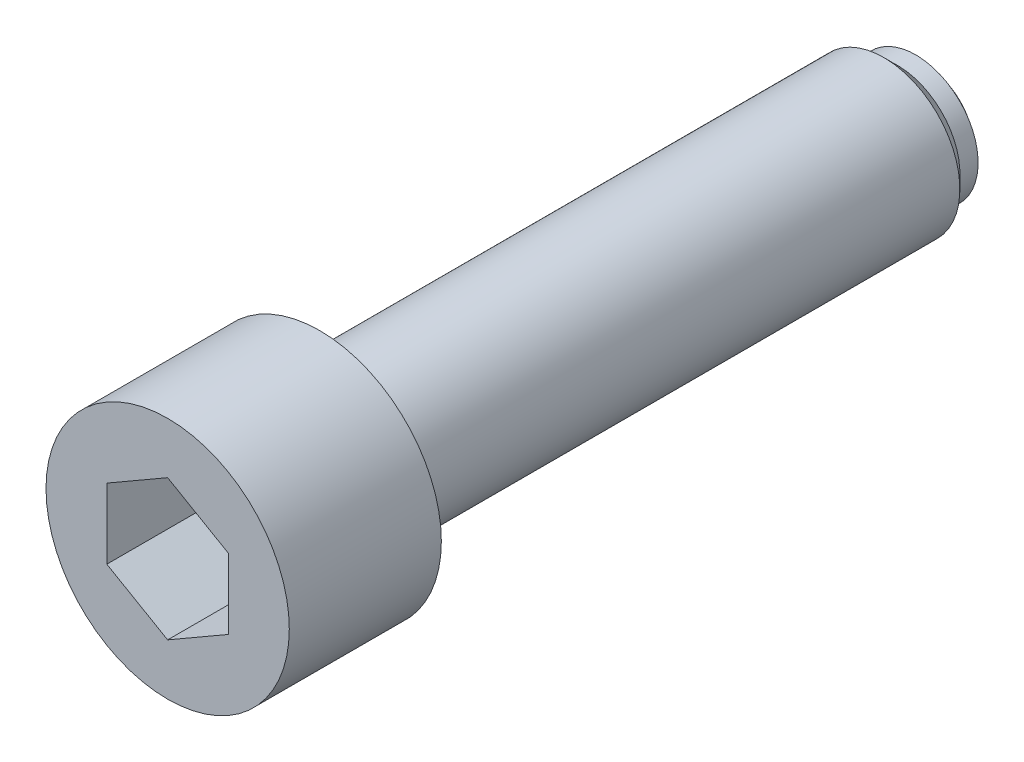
ISO-10303-21;
HEADER;
FILE_DESCRIPTION(('STEP AP214'),'2;1');
FILE_NAME('part.step','',(''),(''),'','','');
FILE_SCHEMA(('AUTOMOTIVE_DESIGN { 1 0 10303 214 1 1 1 1 }'));
ENDSEC;
DATA;
#1=APPLICATION_CONTEXT('core data for automotive mechanical design processes');
#2=APPLICATION_PROTOCOL_DEFINITION('international standard','automotive_design',2000,#1);
#3=PRODUCT_CONTEXT('',#1,'mechanical');
#4=PRODUCT('Part','Part','',(#3));
#5=PRODUCT_RELATED_PRODUCT_CATEGORY('part','',(#4));
#6=PRODUCT_DEFINITION_FORMATION('','',#4);
#7=PRODUCT_DEFINITION_CONTEXT('part definition',#1,'design');
#8=PRODUCT_DEFINITION('design','',#6,#7);
#9=PRODUCT_DEFINITION_SHAPE('','',#8);
#10=(LENGTH_UNIT() NAMED_UNIT(*) SI_UNIT(.MILLI.,.METRE.));
#11=(NAMED_UNIT(*) PLANE_ANGLE_UNIT() SI_UNIT($,.RADIAN.));
#12=(NAMED_UNIT(*) SI_UNIT($,.STERADIAN.) SOLID_ANGLE_UNIT());
#13=UNCERTAINTY_MEASURE_WITH_UNIT(LENGTH_MEASURE(1.E-05),#10,'distance_accuracy_value','');
#14=(GEOMETRIC_REPRESENTATION_CONTEXT(3) GLOBAL_UNCERTAINTY_ASSIGNED_CONTEXT((#13)) GLOBAL_UNIT_ASSIGNED_CONTEXT((#10,
#11,#12)) REPRESENTATION_CONTEXT('',''));
#15=CARTESIAN_POINT('',(0.,0.,0.));
#16=DIRECTION('',(0.,0.,1.));
#17=DIRECTION('',(1.,0.,0.));
#18=AXIS2_PLACEMENT_3D('',#15,#16,#17);
#19=CARTESIAN_POINT('',(0.,0.,0.));
#20=DIRECTION('',(0.,0.,-1.));
#21=DIRECTION('',(-1.,0.,0.));
#22=AXIS2_PLACEMENT_3D('',#19,#20,#21);
#23=PLANE('',#22);
#24=CARTESIAN_POINT('',(0.,0.,0.));
#25=DIRECTION('',(0.,0.,-1.));
#26=DIRECTION('',(-1.,0.,0.));
#27=AXIS2_PLACEMENT_3D('',#24,#25,#26);
#28=CIRCLE('',#27,3.);
#29=CARTESIAN_POINT('',(-3.00000000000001,0.,0.));
#30=VERTEX_POINT('',#29);
#31=EDGE_CURVE('E133',#30,#30,#28,.T.);
#32=ORIENTED_EDGE('',*,*,#31,.T.);
#33=EDGE_LOOP('',(#32));
#34=FACE_BOUND('',#33,.T.);
#35=ADVANCED_FACE('F16',(#34),#23,.T.);
#36=CARTESIAN_POINT('',(-8.,0.,50.));
#37=DIRECTION('',(0.,0.,1.));
#38=DIRECTION('',(1.,0.,0.));
#39=AXIS2_PLACEMENT_3D('',#36,#37,#38);
#40=PLANE('',#39);
#41=DIRECTION('',(-0.866025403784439,0.5,0.));
#42=VECTOR('',#41,1.);
#43=CARTESIAN_POINT('',(4.,2.30940107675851,50.));
#44=LINE('',#43,#42);
#45=CARTESIAN_POINT('',(4.,2.30940107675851,50.));
#46=VERTEX_POINT('',#45);
#47=CARTESIAN_POINT('',(0.,4.61880215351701,50.));
#48=VERTEX_POINT('',#47);
#49=EDGE_CURVE('E31',#46,#48,#44,.T.);
#50=ORIENTED_EDGE('',*,*,#49,.F.);
#51=DIRECTION('',(0.,1.,0.));
#52=VECTOR('',#51,1.);
#53=CARTESIAN_POINT('',(4.,-2.30940107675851,50.));
#54=LINE('',#53,#52);
#55=CARTESIAN_POINT('',(4.,-2.30940107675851,50.));
#56=VERTEX_POINT('',#55);
#57=EDGE_CURVE('E127',#56,#46,#54,.T.);
#58=ORIENTED_EDGE('',*,*,#57,.F.);
#59=DIRECTION('',(0.866025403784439,0.5,0.));
#60=VECTOR('',#59,1.);
#61=CARTESIAN_POINT('',(0.,-4.61880215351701,50.));
#62=LINE('',#61,#60);
#63=CARTESIAN_POINT('',(0.,-4.61880215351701,50.));
#64=VERTEX_POINT('',#63);
#65=EDGE_CURVE('E124',#64,#56,#62,.T.);
#66=ORIENTED_EDGE('',*,*,#65,.F.);
#67=DIRECTION('',(0.866025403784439,-0.5,0.));
#68=VECTOR('',#67,1.);
#69=CARTESIAN_POINT('',(-4.,-2.30940107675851,50.));
#70=LINE('',#69,#68);
#71=CARTESIAN_POINT('',(-4.,-2.30940107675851,50.));
#72=VERTEX_POINT('',#71);
#73=EDGE_CURVE('E79',#72,#64,#70,.T.);
#74=ORIENTED_EDGE('',*,*,#73,.F.);
#75=DIRECTION('',(0.,-1.,0.));
#76=VECTOR('',#75,1.);
#77=CARTESIAN_POINT('',(-4.,2.30940107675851,50.));
#78=LINE('',#77,#76);
#79=CARTESIAN_POINT('',(-4.,2.30940107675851,50.));
#80=VERTEX_POINT('',#79);
#81=EDGE_CURVE('E118',#80,#72,#78,.T.);
#82=ORIENTED_EDGE('',*,*,#81,.F.);
#83=DIRECTION('',(-0.866025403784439,-0.5,0.));
#84=VECTOR('',#83,1.);
#85=CARTESIAN_POINT('',(0.,4.61880215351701,50.));
#86=LINE('',#85,#84);
#87=EDGE_CURVE('E114',#48,#80,#86,.T.);
#88=ORIENTED_EDGE('',*,*,#87,.F.);
#89=EDGE_LOOP('',(#50,#58,#66,#74,#82,#88));
#90=FACE_BOUND('',#89,.T.);
#91=CARTESIAN_POINT('',(0.,0.,50.));
#92=DIRECTION('',(0.,0.,-1.));
#93=DIRECTION('',(-1.,0.,0.));
#94=AXIS2_PLACEMENT_3D('',#91,#92,#93);
#95=CIRCLE('',#94,8.);
#96=CARTESIAN_POINT('',(-8.00000000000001,0.,50.));
#97=VERTEX_POINT('',#96);
#98=EDGE_CURVE('E10',#97,#97,#95,.T.);
#99=ORIENTED_EDGE('',*,*,#98,.F.);
#100=EDGE_LOOP('',(#99));
#101=FACE_BOUND('',#100,.T.);
#102=ADVANCED_FACE('F172',(#90,#101),#40,.T.);
#103=CARTESIAN_POINT('',(0.,0.,0.));
#104=DIRECTION('',(0.,0.,-1.));
#105=DIRECTION('',(-1.,0.,0.));
#106=AXIS2_PLACEMENT_3D('',#103,#104,#105);
#107=CYLINDRICAL_SURFACE('',#106,8.);
#108=ORIENTED_EDGE('',*,*,#98,.T.);
#109=EDGE_LOOP('',(#108));
#110=FACE_BOUND('',#109,.T.);
#111=CARTESIAN_POINT('',(0.,0.,40.));
#112=DIRECTION('',(0.,0.,-1.));
#113=DIRECTION('',(-1.,0.,0.));
#114=AXIS2_PLACEMENT_3D('',#111,#112,#113);
#115=CIRCLE('',#114,8.);
#116=CARTESIAN_POINT('',(-8.00000000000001,0.,40.));
#117=VERTEX_POINT('',#116);
#118=EDGE_CURVE('E24',#117,#117,#115,.T.);
#119=ORIENTED_EDGE('',*,*,#118,.F.);
#120=EDGE_LOOP('',(#119));
#121=FACE_BOUND('',#120,.T.);
#122=ADVANCED_FACE('F170',(#110,#121),#107,.T.);
#123=CARTESIAN_POINT('',(-5.,0.,40.));
#124=DIRECTION('',(0.,0.,-1.));
#125=DIRECTION('',(-1.,0.,0.));
#126=AXIS2_PLACEMENT_3D('',#123,#124,#125);
#127=PLANE('',#126);
#128=ORIENTED_EDGE('',*,*,#118,.T.);
#129=EDGE_LOOP('',(#128));
#130=FACE_BOUND('',#129,.T.);
#131=CARTESIAN_POINT('',(0.,0.,40.));
#132=DIRECTION('',(0.,0.,-1.));
#133=DIRECTION('',(-1.,0.,0.));
#134=AXIS2_PLACEMENT_3D('',#131,#132,#133);
#135=CIRCLE('',#134,5.);
#136=CARTESIAN_POINT('',(-5.00000000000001,0.,40.));
#137=VERTEX_POINT('',#136);
#138=EDGE_CURVE('E160',#137,#137,#135,.T.);
#139=ORIENTED_EDGE('',*,*,#138,.F.);
#140=EDGE_LOOP('',(#139));
#141=FACE_BOUND('',#140,.T.);
#142=ADVANCED_FACE('F167',(#130,#141),#127,.T.);
#143=CARTESIAN_POINT('',(0.,0.,0.));
#144=DIRECTION('',(0.,0.,-1.));
#145=DIRECTION('',(-1.,0.,0.));
#146=AXIS2_PLACEMENT_3D('',#143,#144,#145);
#147=CYLINDRICAL_SURFACE('',#146,5.);
#148=ORIENTED_EDGE('',*,*,#138,.T.);
#149=EDGE_LOOP('',(#148));
#150=FACE_BOUND('',#149,.T.);
#151=CARTESIAN_POINT('',(0.,0.,2.9));
#152=DIRECTION('',(0.,0.,-1.));
#153=DIRECTION('',(-1.,0.,0.));
#154=AXIS2_PLACEMENT_3D('',#151,#152,#153);
#155=CIRCLE('',#154,5.);
#156=CARTESIAN_POINT('',(-5.00000000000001,0.,2.9));
#157=VERTEX_POINT('',#156);
#158=EDGE_CURVE('E156',#157,#157,#155,.T.);
#159=ORIENTED_EDGE('',*,*,#158,.F.);
#160=EDGE_LOOP('',(#159));
#161=FACE_BOUND('',#160,.T.);
#162=ADVANCED_FACE('F181',(#150,#161),#147,.T.);
#163=CARTESIAN_POINT('',(0.,0.,2.));
#164=DIRECTION('',(0.,0.,1.));
#165=DIRECTION('',(1.,0.,0.));
#166=AXIS2_PLACEMENT_3D('',#163,#164,#165);
#167=CONICAL_SURFACE('',#166,4.1,0.785398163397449);
#168=ORIENTED_EDGE('',*,*,#158,.T.);
#169=EDGE_LOOP('',(#168));
#170=FACE_BOUND('',#169,.T.);
#171=CARTESIAN_POINT('',(0.,0.,2.));
#172=DIRECTION('',(0.,0.,-1.));
#173=DIRECTION('',(-1.,0.,0.));
#174=AXIS2_PLACEMENT_3D('',#171,#172,#173);
#175=CIRCLE('',#174,4.1);
#176=CARTESIAN_POINT('',(-4.10000000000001,0.,2.));
#177=VERTEX_POINT('',#176);
#178=EDGE_CURVE('E152',#177,#177,#175,.T.);
#179=ORIENTED_EDGE('',*,*,#178,.F.);
#180=EDGE_LOOP('',(#179));
#181=FACE_BOUND('',#180,.T.);
#182=ADVANCED_FACE('F211',(#170,#181),#167,.T.);
#183=CARTESIAN_POINT('',(0.,0.,0.));
#184=DIRECTION('',(0.,0.,-1.));
#185=DIRECTION('',(-1.,0.,0.));
#186=AXIS2_PLACEMENT_3D('',#183,#184,#185);
#187=CYLINDRICAL_SURFACE('',#186,4.1);
#188=ORIENTED_EDGE('',*,*,#178,.T.);
#189=EDGE_LOOP('',(#188));
#190=FACE_BOUND('',#189,.T.);
#191=CARTESIAN_POINT('',(0.,0.,0.8));
#192=DIRECTION('',(0.,0.,-1.));
#193=DIRECTION('',(-1.,0.,0.));
#194=AXIS2_PLACEMENT_3D('',#191,#192,#193);
#195=CIRCLE('',#194,4.1);
#196=CARTESIAN_POINT('',(-4.10000000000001,0.,0.8));
#197=VERTEX_POINT('',#196);
#198=EDGE_CURVE('E148',#197,#197,#195,.T.);
#199=ORIENTED_EDGE('',*,*,#198,.F.);
#200=EDGE_LOOP('',(#199));
#201=FACE_BOUND('',#200,.T.);
#202=ADVANCED_FACE('F204',(#190,#201),#187,.T.);
#203=CARTESIAN_POINT('',(-3.35327318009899,0.,0.8));
#204=DIRECTION('',(0.,0.,-1.));
#205=DIRECTION('',(-1.,0.,0.));
#206=AXIS2_PLACEMENT_3D('',#203,#204,#205);
#207=PLANE('',#206);
#208=ORIENTED_EDGE('',*,*,#198,.T.);
#209=EDGE_LOOP('',(#208));
#210=FACE_BOUND('',#209,.T.);
#211=CARTESIAN_POINT('',(0.,0.,0.8));
#212=DIRECTION('',(0.,0.,-1.));
#213=DIRECTION('',(-1.,0.,0.));
#214=AXIS2_PLACEMENT_3D('',#211,#212,#213);
#215=CIRCLE('',#214,3.35327318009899);
#216=CARTESIAN_POINT('',(-3.353273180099,0.,0.8));
#217=VERTEX_POINT('',#216);
#218=EDGE_CURVE('E144',#217,#217,#215,.T.);
#219=ORIENTED_EDGE('',*,*,#218,.F.);
#220=EDGE_LOOP('',(#219));
#221=FACE_BOUND('',#220,.T.);
#222=ADVANCED_FACE('F194',(#210,#221),#207,.T.);
#223=CARTESIAN_POINT('',(0.,0.,1.802775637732));
#224=DIRECTION('',(0.,0.,-1.));
#225=DIRECTION('',(-1.,0.,0.));
#226=AXIS2_PLACEMENT_3D('',#223,#224,#225);
#227=SPHERICAL_SURFACE('',#226,3.5);
#228=CARTESIAN_POINT('',(-3.353273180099,0.,0.8));
#229=CARTESIAN_POINT('',(-3.35065635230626,0.,0.791249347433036));
#230=CARTESIAN_POINT('',(-3.34800526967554,0.,0.782508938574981));
#231=CARTESIAN_POINT('',(-3.34263476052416,0.,0.765049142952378));
#232=CARTESIAN_POINT('',(-3.33991533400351,0.,0.75632975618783));
#233=CARTESIAN_POINT('',(-3.33440830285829,0.,0.738912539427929));
#234=CARTESIAN_POINT('',(-3.33162069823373,0.,0.730214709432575));
#235=CARTESIAN_POINT('',(-3.32597748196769,0.,0.712841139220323));
#236=CARTESIAN_POINT('',(-3.32312187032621,0.,0.704165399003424));
#237=CARTESIAN_POINT('',(-3.31734281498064,0.,0.686836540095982));
#238=CARTESIAN_POINT('',(-3.31441937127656,0.,0.67818342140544));
#239=CARTESIAN_POINT('',(-3.30850483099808,0.,0.660900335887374));
#240=CARTESIAN_POINT('',(-3.30551373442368,0.,0.65227036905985));
#241=CARTESIAN_POINT('',(-3.29946407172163,0.,0.635034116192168));
#242=CARTESIAN_POINT('',(-3.29640550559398,0.,0.62642783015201));
#243=CARTESIAN_POINT('',(-3.29022109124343,0.,0.609239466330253));
#244=CARTESIAN_POINT('',(-3.28709524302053,0.,0.600657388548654));
#245=CARTESIAN_POINT('',(-3.2807764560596,0.,0.583517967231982));
#246=CARTESIAN_POINT('',(-3.27758351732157,0.,0.57496062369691));
#247=CARTESIAN_POINT('',(-3.27113074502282,0.,0.55787119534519));
#248=CARTESIAN_POINT('',(-3.2678709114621,0.,0.549339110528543));
#249=CARTESIAN_POINT('',(-3.26128454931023,0.,0.532300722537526));
#250=CARTESIAN_POINT('',(-3.25795802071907,0.,0.523794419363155));
#251=CARTESIAN_POINT('',(-3.25123847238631,0.,0.506808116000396));
#252=CARTESIAN_POINT('',(-3.24784545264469,0.,0.498328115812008));
#253=CARTESIAN_POINT('',(-3.24099312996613,0.,0.481394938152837));
#254=CARTESIAN_POINT('',(-3.23753382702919,0.,0.472941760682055));
#255=CARTESIAN_POINT('',(-3.23054914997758,0.,0.456062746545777));
#256=CARTESIAN_POINT('',(-3.2270237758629,0.,0.447636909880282));
#257=CARTESIAN_POINT('',(-3.21990717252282,0.,0.430813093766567));
#258=CARTESIAN_POINT('',(-3.21631594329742,0.,0.422415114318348));
#259=CARTESIAN_POINT('',(-3.20906784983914,0.,0.40564752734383));
#260=CARTESIAN_POINT('',(-3.20541098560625,0.,0.397277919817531));
#261=CARTESIAN_POINT('',(-3.19803184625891,0.,0.380567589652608));
#262=CARTESIAN_POINT('',(-3.19430957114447,0.,0.372226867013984));
#263=CARTESIAN_POINT('',(-3.18679983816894,0.,0.355574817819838));
#264=CARTESIAN_POINT('',(-3.18301238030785,0.,0.347263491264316));
#265=CARTESIAN_POINT('',(-3.17537251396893,0.,0.330670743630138));
#266=CARTESIAN_POINT('',(-3.17152010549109,0.,0.322389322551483));
#267=CARTESIAN_POINT('',(-3.16375057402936,0.,0.305856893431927));
#268=CARTESIAN_POINT('',(-3.15983345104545,0.,0.297605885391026));
#269=CARTESIAN_POINT('',(-3.15193473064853,0.,0.281134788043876));
#270=CARTESIAN_POINT('',(-3.14795313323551,0.,0.272914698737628));
#271=CARTESIAN_POINT('',(-3.1399257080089,0.,0.256505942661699));
#272=CARTESIAN_POINT('',(-3.13587988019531,0.,0.248317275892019));
#273=CARTESIAN_POINT('',(-3.12772424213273,0.,0.231971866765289));
#274=CARTESIAN_POINT('',(-3.12361443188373,0.,0.223815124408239));
#275=CARTESIAN_POINT('',(-3.11533108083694,0.,0.207534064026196));
#276=CARTESIAN_POINT('',(-3.11115754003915,0.,0.199409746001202));
#277=CARTESIAN_POINT('',(-3.10274698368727,0.,0.183194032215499));
#278=CARTESIAN_POINT('',(-3.09850996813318,0.,0.175102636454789));
#279=CARTESIAN_POINT('',(-3.0899727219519,0.,0.158953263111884));
#280=CARTESIAN_POINT('',(-3.0856724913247,0.,0.150895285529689));
#281=CARTESIAN_POINT('',(-3.07700907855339,0.,0.134813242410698));
#282=CARTESIAN_POINT('',(-3.07264589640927,0.,0.126789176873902));
#283=CARTESIAN_POINT('',(-3.06385684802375,0.,0.110775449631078));
#284=CARTESIAN_POINT('',(-3.05943098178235,0.,0.10278578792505));
#285=CARTESIAN_POINT('',(-3.0505168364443,0.,0.0868413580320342));
#286=CARTESIAN_POINT('',(-3.04602855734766,0.,0.0788865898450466));
#287=CARTESIAN_POINT('',(-3.03698986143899,0.,0.0630124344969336));
#288=CARTESIAN_POINT('',(-3.03243944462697,0.,0.0550930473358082));
#289=CARTESIAN_POINT('',(-3.02327675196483,0.,0.0392901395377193));
#290=CARTESIAN_POINT('',(-3.01866447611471,0.,0.0314066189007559));
#291=CARTESIAN_POINT('',(-3.00937834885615,0.,0.0156759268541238));
#292=CARTESIAN_POINT('',(-3.00470449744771,0.,0.00782875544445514));
#293=CARTESIAN_POINT('',(-3.00000000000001,0.,0.));
#294=B_SPLINE_CURVE_WITH_KNOTS('',3,(#228,#229,#230,#231,#232,#233,#234,#235,#236,#237,#238,
#239,#240,#241,#242,#243,#244,#245,#246,#247,#248,#249,#250,#251,#252,#253,#254,#255,#256,#257,
#258,#259,#260,#261,#262,#263,#264,#265,#266,#267,#268,#269,#270,#271,#272,#273,#274,#275,#276,
#277,#278,#279,#280,#281,#282,#283,#284,#285,#286,#287,#288,#289,#290,#291,#292,#293),
.UNSPECIFIED.,.F.,.F.,(4,2,2,2,2,2,2,2,2,2,2,2,2,2,2,2,2,2,2,2,2,2,2,2,2,2,2,2,2,2,2,2,4),(0.,
0.027400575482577,0.0548011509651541,0.0822017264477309,0.109602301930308,0.137002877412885,
0.164403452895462,0.191804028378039,0.219204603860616,0.246605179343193,0.27400575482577,
0.301406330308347,0.328806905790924,0.356207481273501,0.383608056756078,0.411008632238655,
0.438409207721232,0.465809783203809,0.493210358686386,0.520610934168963,0.54801150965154,
0.575412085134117,0.602812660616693,0.63021323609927,0.657613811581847,0.685014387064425,
0.712414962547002,0.739815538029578,0.767216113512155,0.794616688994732,0.822017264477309,
0.849417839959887,0.876818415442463),.UNSPECIFIED.);
#295=EDGE_CURVE('BSEAM191',#217,#30,#294,.T.);
#296=ORIENTED_EDGE('',*,*,#218,.T.);
#297=ORIENTED_EDGE('',*,*,#31,.F.);
#298=ORIENTED_EDGE('',*,*,#295,.T.);
#299=ORIENTED_EDGE('',*,*,#295,.F.);
#300=EDGE_LOOP('',(#296,#298,#297,#299));
#301=FACE_BOUND('',#300,.T.);
#302=ADVANCED_FACE('F191',(#301),#227,.T.);
#303=CARTESIAN_POINT('',(4.,2.30940107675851,40.));
#304=DIRECTION('',(0.5,0.866025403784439,0.));
#305=DIRECTION('',(-0.866025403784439,0.5,0.));
#306=AXIS2_PLACEMENT_3D('',#303,#304,#305);
#307=PLANE('',#306);
#308=ORIENTED_EDGE('',*,*,#49,.T.);
#309=DIRECTION('',(0.,0.,1.));
#310=VECTOR('',#309,1.);
#311=CARTESIAN_POINT('',(0.,4.61880215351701,40.));
#312=LINE('',#311,#310);
#313=CARTESIAN_POINT('',(0.,4.61880215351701,40.));
#314=VERTEX_POINT('',#313);
#315=EDGE_CURVE('E61',#314,#48,#312,.T.);
#316=ORIENTED_EDGE('',*,*,#315,.F.);
#317=DIRECTION('',(-0.866025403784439,0.5,0.));
#318=VECTOR('',#317,1.);
#319=CARTESIAN_POINT('',(4.,2.30940107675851,40.));
#320=LINE('',#319,#318);
#321=CARTESIAN_POINT('',(4.,2.30940107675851,40.));
#322=VERTEX_POINT('',#321);
#323=EDGE_CURVE('E130',#322,#314,#320,.T.);
#324=ORIENTED_EDGE('',*,*,#323,.F.);
#325=DIRECTION('',(0.,0.,1.));
#326=VECTOR('',#325,1.);
#327=CARTESIAN_POINT('',(4.,2.30940107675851,40.));
#328=LINE('',#327,#326);
#329=EDGE_CURVE('E39',#322,#46,#328,.T.);
#330=ORIENTED_EDGE('',*,*,#329,.T.);
#331=EDGE_LOOP('',(#308,#316,#324,#330));
#332=FACE_BOUND('',#331,.T.);
#333=ADVANCED_FACE('F193',(#332),#307,.F.);
#334=CARTESIAN_POINT('',(4.,-2.30940107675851,40.));
#335=DIRECTION('',(1.,0.,0.));
#336=DIRECTION('',(0.,1.,0.));
#337=AXIS2_PLACEMENT_3D('',#334,#335,#336);
#338=PLANE('',#337);
#339=ORIENTED_EDGE('',*,*,#57,.T.);
#340=ORIENTED_EDGE('',*,*,#329,.F.);
#341=DIRECTION('',(0.,1.,0.));
#342=VECTOR('',#341,1.);
#343=CARTESIAN_POINT('',(4.,-2.30940107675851,40.));
#344=LINE('',#343,#342);
#345=CARTESIAN_POINT('',(4.,-2.30940107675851,40.));
#346=VERTEX_POINT('',#345);
#347=EDGE_CURVE('E93',#346,#322,#344,.T.);
#348=ORIENTED_EDGE('',*,*,#347,.F.);
#349=DIRECTION('',(0.,0.,1.));
#350=VECTOR('',#349,1.);
#351=CARTESIAN_POINT('',(4.,-2.30940107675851,40.));
#352=LINE('',#351,#350);
#353=EDGE_CURVE('E84',#346,#56,#352,.T.);
#354=ORIENTED_EDGE('',*,*,#353,.T.);
#355=EDGE_LOOP('',(#339,#340,#348,#354));
#356=FACE_BOUND('',#355,.T.);
#357=ADVANCED_FACE('F202',(#356),#338,.F.);
#358=CARTESIAN_POINT('',(0.,-4.61880215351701,40.));
#359=DIRECTION('',(0.5,-0.866025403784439,0.));
#360=DIRECTION('',(0.866025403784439,0.5,0.));
#361=AXIS2_PLACEMENT_3D('',#358,#359,#360);
#362=PLANE('',#361);
#363=ORIENTED_EDGE('',*,*,#65,.T.);
#364=ORIENTED_EDGE('',*,*,#353,.F.);
#365=DIRECTION('',(0.866025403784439,0.5,0.));
#366=VECTOR('',#365,1.);
#367=CARTESIAN_POINT('',(0.,-4.61880215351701,40.));
#368=LINE('',#367,#366);
#369=CARTESIAN_POINT('',(0.,-4.61880215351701,40.));
#370=VERTEX_POINT('',#369);
#371=EDGE_CURVE('E88',#370,#346,#368,.T.);
#372=ORIENTED_EDGE('',*,*,#371,.F.);
#373=DIRECTION('',(0.,0.,1.));
#374=VECTOR('',#373,1.);
#375=CARTESIAN_POINT('',(0.,-4.61880215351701,40.));
#376=LINE('',#375,#374);
#377=EDGE_CURVE('E72',#370,#64,#376,.T.);
#378=ORIENTED_EDGE('',*,*,#377,.T.);
#379=EDGE_LOOP('',(#363,#364,#372,#378));
#380=FACE_BOUND('',#379,.T.);
#381=ADVANCED_FACE('F89',(#380),#362,.F.);
#382=CARTESIAN_POINT('',(-4.,-2.30940107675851,40.));
#383=DIRECTION('',(-0.5,-0.866025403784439,0.));
#384=DIRECTION('',(0.866025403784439,-0.5,0.));
#385=AXIS2_PLACEMENT_3D('',#382,#383,#384);
#386=PLANE('',#385);
#387=ORIENTED_EDGE('',*,*,#73,.T.);
#388=ORIENTED_EDGE('',*,*,#377,.F.);
#389=DIRECTION('',(0.866025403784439,-0.5,0.));
#390=VECTOR('',#389,1.);
#391=CARTESIAN_POINT('',(-4.,-2.30940107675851,40.));
#392=LINE('',#391,#390);
#393=CARTESIAN_POINT('',(-4.,-2.30940107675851,40.));
#394=VERTEX_POINT('',#393);
#395=EDGE_CURVE('E76',#394,#370,#392,.T.);
#396=ORIENTED_EDGE('',*,*,#395,.F.);
#397=DIRECTION('',(0.,0.,1.));
#398=VECTOR('',#397,1.);
#399=CARTESIAN_POINT('',(-4.,-2.30940107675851,40.));
#400=LINE('',#399,#398);
#401=EDGE_CURVE('E85',#394,#72,#400,.T.);
#402=ORIENTED_EDGE('',*,*,#401,.T.);
#403=EDGE_LOOP('',(#387,#388,#396,#402));
#404=FACE_BOUND('',#403,.T.);
#405=ADVANCED_FACE('F74',(#404),#386,.F.);
#406=CARTESIAN_POINT('',(-4.,2.30940107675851,40.));
#407=DIRECTION('',(-1.,0.,0.));
#408=DIRECTION('',(0.,0.,1.));
#409=AXIS2_PLACEMENT_3D('',#406,#407,#408);
#410=PLANE('',#409);
#411=ORIENTED_EDGE('',*,*,#81,.T.);
#412=ORIENTED_EDGE('',*,*,#401,.F.);
#413=DIRECTION('',(0.,-1.,0.));
#414=VECTOR('',#413,1.);
#415=CARTESIAN_POINT('',(-4.,2.30940107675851,40.));
#416=LINE('',#415,#414);
#417=CARTESIAN_POINT('',(-4.,2.30940107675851,40.));
#418=VERTEX_POINT('',#417);
#419=EDGE_CURVE('E99',#418,#394,#416,.T.);
#420=ORIENTED_EDGE('',*,*,#419,.F.);
#421=DIRECTION('',(0.,0.,1.));
#422=VECTOR('',#421,1.);
#423=CARTESIAN_POINT('',(-4.,2.30940107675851,40.));
#424=LINE('',#423,#422);
#425=EDGE_CURVE('E136',#418,#80,#424,.T.);
#426=ORIENTED_EDGE('',*,*,#425,.T.);
#427=EDGE_LOOP('',(#411,#412,#420,#426));
#428=FACE_BOUND('',#427,.T.);
#429=ADVANCED_FACE('F304',(#428),#410,.F.);
#430=CARTESIAN_POINT('',(0.,4.61880215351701,40.));
#431=DIRECTION('',(-0.5,0.866025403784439,0.));
#432=DIRECTION('',(-0.866025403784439,-0.5,0.));
#433=AXIS2_PLACEMENT_3D('',#430,#431,#432);
#434=PLANE('',#433);
#435=ORIENTED_EDGE('',*,*,#87,.T.);
#436=ORIENTED_EDGE('',*,*,#425,.F.);
#437=DIRECTION('',(-0.866025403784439,-0.5,0.));
#438=VECTOR('',#437,1.);
#439=CARTESIAN_POINT('',(0.,4.61880215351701,40.));
#440=LINE('',#439,#438);
#441=EDGE_CURVE('E106',#314,#418,#440,.T.);
#442=ORIENTED_EDGE('',*,*,#441,.F.);
#443=ORIENTED_EDGE('',*,*,#315,.T.);
#444=EDGE_LOOP('',(#435,#436,#442,#443));
#445=FACE_BOUND('',#444,.T.);
#446=ADVANCED_FACE('F312',(#445),#434,.F.);
#447=CARTESIAN_POINT('',(0.,0.,40.));
#448=DIRECTION('',(0.,0.,1.));
#449=DIRECTION('',(1.,0.,0.));
#450=AXIS2_PLACEMENT_3D('',#447,#448,#449);
#451=PLANE('',#450);
#452=ORIENTED_EDGE('',*,*,#323,.T.);
#453=ORIENTED_EDGE('',*,*,#441,.T.);
#454=ORIENTED_EDGE('',*,*,#419,.T.);
#455=ORIENTED_EDGE('',*,*,#395,.T.);
#456=ORIENTED_EDGE('',*,*,#371,.T.);
#457=ORIENTED_EDGE('',*,*,#347,.T.);
#458=EDGE_LOOP('',(#452,#453,#454,#455,#456,#457));
#459=FACE_BOUND('',#458,.T.);
#460=ADVANCED_FACE('F96',(#459),#451,.T.);
#461=CLOSED_SHELL('',(#35,#102,#122,#142,#162,#182,#202,#222,#302,#333,#357,#381,#405,#429,#446,#460));
#462=MANIFOLD_SOLID_BREP('B1',#461);
#463=ADVANCED_BREP_SHAPE_REPRESENTATION('',(#18,#462),#14);
#464=SHAPE_DEFINITION_REPRESENTATION(#9,#463);
ENDSEC;
END-ISO-10303-21;
